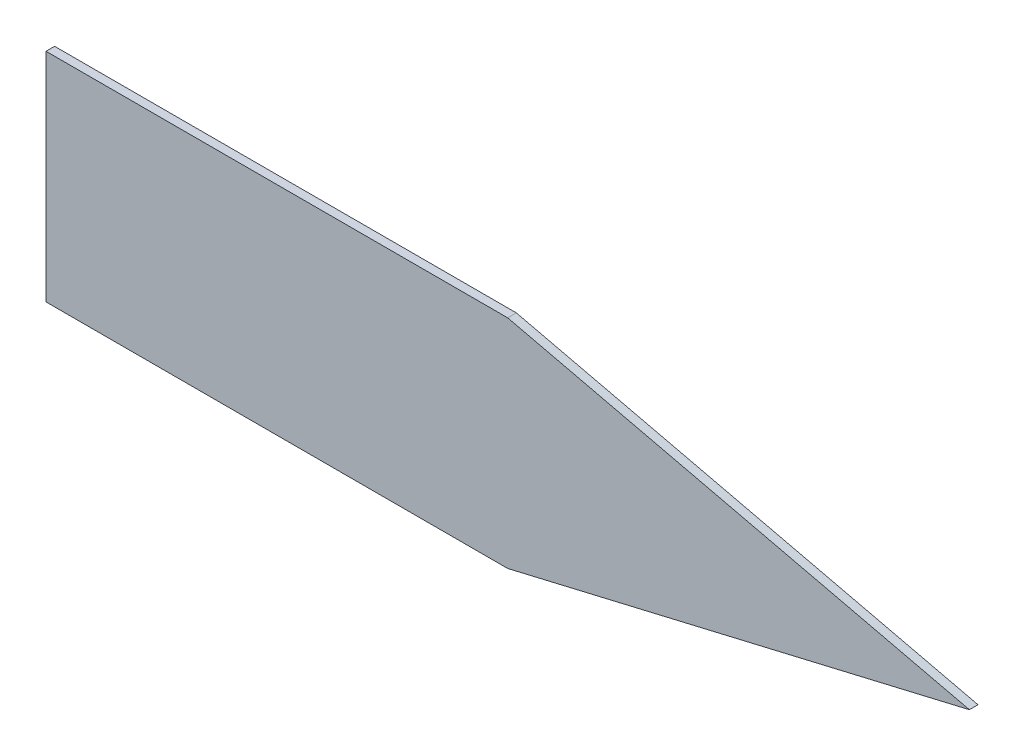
ISO-10303-21;
HEADER;
FILE_DESCRIPTION(('STEP AP214'),'2;1');
FILE_NAME('part.step','',(''),(''),'','','');
FILE_SCHEMA(('AUTOMOTIVE_DESIGN { 1 0 10303 214 1 1 1 1 }'));
ENDSEC;
DATA;
#1=APPLICATION_CONTEXT('core data for automotive mechanical design processes');
#2=APPLICATION_PROTOCOL_DEFINITION('international standard','automotive_design',2000,#1);
#3=PRODUCT_CONTEXT('',#1,'mechanical');
#4=PRODUCT('Part','Part','',(#3));
#5=PRODUCT_RELATED_PRODUCT_CATEGORY('part','',(#4));
#6=PRODUCT_DEFINITION_FORMATION('','',#4);
#7=PRODUCT_DEFINITION_CONTEXT('part definition',#1,'design');
#8=PRODUCT_DEFINITION('design','',#6,#7);
#9=PRODUCT_DEFINITION_SHAPE('','',#8);
#10=(LENGTH_UNIT() NAMED_UNIT(*) SI_UNIT(.MILLI.,.METRE.));
#11=(NAMED_UNIT(*) PLANE_ANGLE_UNIT() SI_UNIT($,.RADIAN.));
#12=(NAMED_UNIT(*) SI_UNIT($,.STERADIAN.) SOLID_ANGLE_UNIT());
#13=UNCERTAINTY_MEASURE_WITH_UNIT(LENGTH_MEASURE(1.E-05),#10,'distance_accuracy_value','');
#14=(GEOMETRIC_REPRESENTATION_CONTEXT(3) GLOBAL_UNCERTAINTY_ASSIGNED_CONTEXT((#13)) GLOBAL_UNIT_ASSIGNED_CONTEXT((#10,
#11,#12)) REPRESENTATION_CONTEXT('',''));
#15=CARTESIAN_POINT('',(0.,0.,0.));
#16=DIRECTION('',(0.,0.,1.));
#17=DIRECTION('',(1.,0.,0.));
#18=AXIS2_PLACEMENT_3D('',#15,#16,#17);
#19=CARTESIAN_POINT('',(-53.5985260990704,-12.6006072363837,0.5));
#20=DIRECTION('',(1.,0.,0.));
#21=DIRECTION('',(0.,0.,-1.));
#22=AXIS2_PLACEMENT_3D('',#19,#20,#21);
#23=PLANE('',#22);
#24=DIRECTION('',(0.,-1.,0.));
#25=VECTOR('',#24,1.);
#26=CARTESIAN_POINT('',(-53.5985260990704,-12.6006072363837,-0.5));
#27=LINE('',#26,#25);
#28=CARTESIAN_POINT('',(-53.5985260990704,12.6006072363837,-0.5));
#29=VERTEX_POINT('',#28);
#30=CARTESIAN_POINT('',(-53.5985260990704,-12.6006072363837,-0.5));
#31=VERTEX_POINT('',#30);
#32=EDGE_CURVE('E107',#29,#31,#27,.T.);
#33=ORIENTED_EDGE('',*,*,#32,.T.);
#34=DIRECTION('',(0.,0.,-1.));
#35=VECTOR('',#34,1.);
#36=CARTESIAN_POINT('',(-53.5985260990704,-12.6006072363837,0.5));
#37=LINE('',#36,#35);
#38=CARTESIAN_POINT('',(-53.5985260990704,-12.6006072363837,0.5));
#39=VERTEX_POINT('',#38);
#40=EDGE_CURVE('E11',#39,#31,#37,.T.);
#41=ORIENTED_EDGE('',*,*,#40,.F.);
#42=DIRECTION('',(0.,-1.,0.));
#43=VECTOR('',#42,1.);
#44=CARTESIAN_POINT('',(-53.5985260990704,-12.6006072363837,0.5));
#45=LINE('',#44,#43);
#46=CARTESIAN_POINT('',(-53.5985260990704,12.6006072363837,0.5));
#47=VERTEX_POINT('',#46);
#48=EDGE_CURVE('E115',#47,#39,#45,.T.);
#49=ORIENTED_EDGE('',*,*,#48,.F.);
#50=DIRECTION('',(0.,0.,-1.));
#51=VECTOR('',#50,1.);
#52=CARTESIAN_POINT('',(-53.5985260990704,12.6006072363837,0.5));
#53=LINE('',#52,#51);
#54=EDGE_CURVE('E103',#47,#29,#53,.T.);
#55=ORIENTED_EDGE('',*,*,#54,.T.);
#56=EDGE_LOOP('',(#33,#41,#49,#55));
#57=FACE_BOUND('',#56,.T.);
#58=ADVANCED_FACE('F33',(#57),#23,.F.);
#59=CARTESIAN_POINT('',(0.,-12.6006072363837,0.5));
#60=DIRECTION('',(0.,1.,0.));
#61=DIRECTION('',(0.,0.,1.));
#62=AXIS2_PLACEMENT_3D('',#59,#60,#61);
#63=PLANE('',#62);
#64=DIRECTION('',(1.,0.,0.));
#65=VECTOR('',#64,1.);
#66=CARTESIAN_POINT('',(0.,-12.6006072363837,-0.5));
#67=LINE('',#66,#65);
#68=CARTESIAN_POINT('',(0.,-12.6006072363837,-0.5));
#69=VERTEX_POINT('',#68);
#70=EDGE_CURVE('E110',#31,#69,#67,.T.);
#71=ORIENTED_EDGE('',*,*,#70,.T.);
#72=DIRECTION('',(0.,0.,-1.));
#73=VECTOR('',#72,1.);
#74=CARTESIAN_POINT('',(0.,-12.6006072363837,0.5));
#75=LINE('',#74,#73);
#76=CARTESIAN_POINT('',(0.,-12.6006072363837,0.5));
#77=VERTEX_POINT('',#76);
#78=EDGE_CURVE('E41',#77,#69,#75,.T.);
#79=ORIENTED_EDGE('',*,*,#78,.F.);
#80=DIRECTION('',(1.,0.,0.));
#81=VECTOR('',#80,1.);
#82=CARTESIAN_POINT('',(0.,-12.6006072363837,0.5));
#83=LINE('',#82,#81);
#84=EDGE_CURVE('E83',#39,#77,#83,.T.);
#85=ORIENTED_EDGE('',*,*,#84,.F.);
#86=ORIENTED_EDGE('',*,*,#40,.T.);
#87=EDGE_LOOP('',(#71,#79,#85,#86));
#88=FACE_BOUND('',#87,.T.);
#89=ADVANCED_FACE('F134',(#88),#63,.F.);
#90=CARTESIAN_POINT('',(0.,-12.6006072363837,0.5));
#91=DIRECTION('',(-0.228853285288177,0.973460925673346,0.));
#92=DIRECTION('',(-0.973460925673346,-0.228853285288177,0.));
#93=AXIS2_PLACEMENT_3D('',#90,#91,#92);
#94=PLANE('',#93);
#95=DIRECTION('',(0.973460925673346,0.228853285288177,0.));
#96=VECTOR('',#95,1.);
#97=CARTESIAN_POINT('',(0.,-12.6006072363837,-0.5));
#98=LINE('',#97,#96);
#99=CARTESIAN_POINT('',(53.5985260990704,0.,-0.5));
#100=VERTEX_POINT('',#99);
#101=EDGE_CURVE('E98',#69,#100,#98,.T.);
#102=ORIENTED_EDGE('',*,*,#101,.T.);
#103=DIRECTION('',(0.,0.,-1.));
#104=VECTOR('',#103,1.);
#105=CARTESIAN_POINT('',(53.5985260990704,0.,0.5));
#106=LINE('',#105,#104);
#107=CARTESIAN_POINT('',(53.5985260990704,0.,0.5));
#108=VERTEX_POINT('',#107);
#109=EDGE_CURVE('E95',#108,#100,#106,.T.);
#110=ORIENTED_EDGE('',*,*,#109,.F.);
#111=DIRECTION('',(0.973460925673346,0.228853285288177,0.));
#112=VECTOR('',#111,1.);
#113=CARTESIAN_POINT('',(0.,-12.6006072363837,0.5));
#114=LINE('',#113,#112);
#115=EDGE_CURVE('E87',#77,#108,#114,.T.);
#116=ORIENTED_EDGE('',*,*,#115,.F.);
#117=ORIENTED_EDGE('',*,*,#78,.T.);
#118=EDGE_LOOP('',(#102,#110,#116,#117));
#119=FACE_BOUND('',#118,.T.);
#120=ADVANCED_FACE('F96',(#119),#94,.F.);
#121=CARTESIAN_POINT('',(53.5985260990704,0.,0.5));
#122=DIRECTION('',(-0.228853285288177,-0.973460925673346,0.));
#123=DIRECTION('',(0.973460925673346,-0.228853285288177,0.));
#124=AXIS2_PLACEMENT_3D('',#121,#122,#123);
#125=PLANE('',#124);
#126=DIRECTION('',(-0.973460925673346,0.228853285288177,0.));
#127=VECTOR('',#126,1.);
#128=CARTESIAN_POINT('',(53.5985260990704,0.,-0.5));
#129=LINE('',#128,#127);
#130=CARTESIAN_POINT('',(0.,12.6006072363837,-0.5));
#131=VERTEX_POINT('',#130);
#132=EDGE_CURVE('E69',#100,#131,#129,.T.);
#133=ORIENTED_EDGE('',*,*,#132,.T.);
#134=DIRECTION('',(0.,0.,-1.));
#135=VECTOR('',#134,1.);
#136=CARTESIAN_POINT('',(0.,12.6006072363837,0.5));
#137=LINE('',#136,#135);
#138=CARTESIAN_POINT('',(0.,12.6006072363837,0.5));
#139=VERTEX_POINT('',#138);
#140=EDGE_CURVE('E99',#139,#131,#137,.T.);
#141=ORIENTED_EDGE('',*,*,#140,.F.);
#142=DIRECTION('',(-0.973460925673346,0.228853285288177,0.));
#143=VECTOR('',#142,1.);
#144=CARTESIAN_POINT('',(53.5985260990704,0.,0.5));
#145=LINE('',#144,#143);
#146=EDGE_CURVE('E91',#108,#139,#145,.T.);
#147=ORIENTED_EDGE('',*,*,#146,.F.);
#148=ORIENTED_EDGE('',*,*,#109,.T.);
#149=EDGE_LOOP('',(#133,#141,#147,#148));
#150=FACE_BOUND('',#149,.T.);
#151=ADVANCED_FACE('F101',(#150),#125,.F.);
#152=CARTESIAN_POINT('',(0.,12.6006072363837,0.5));
#153=DIRECTION('',(0.,-1.,0.));
#154=DIRECTION('',(0.,0.,-1.));
#155=AXIS2_PLACEMENT_3D('',#152,#153,#154);
#156=PLANE('',#155);
#157=DIRECTION('',(-1.,0.,0.));
#158=VECTOR('',#157,1.);
#159=CARTESIAN_POINT('',(0.,12.6006072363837,-0.5));
#160=LINE('',#159,#158);
#161=EDGE_CURVE('E75',#131,#29,#160,.T.);
#162=ORIENTED_EDGE('',*,*,#161,.T.);
#163=ORIENTED_EDGE('',*,*,#54,.F.);
#164=DIRECTION('',(-1.,0.,0.));
#165=VECTOR('',#164,1.);
#166=CARTESIAN_POINT('',(0.,12.6006072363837,0.5));
#167=LINE('',#166,#165);
#168=EDGE_CURVE('E49',#139,#47,#167,.T.);
#169=ORIENTED_EDGE('',*,*,#168,.F.);
#170=ORIENTED_EDGE('',*,*,#140,.T.);
#171=EDGE_LOOP('',(#162,#163,#169,#170));
#172=FACE_BOUND('',#171,.T.);
#173=ADVANCED_FACE('F123',(#172),#156,.F.);
#174=CARTESIAN_POINT('',(0.,0.,0.5));
#175=DIRECTION('',(0.,0.,1.));
#176=DIRECTION('',(1.,0.,0.));
#177=AXIS2_PLACEMENT_3D('',#174,#175,#176);
#178=PLANE('',#177);
#179=ORIENTED_EDGE('',*,*,#48,.T.);
#180=ORIENTED_EDGE('',*,*,#84,.T.);
#181=ORIENTED_EDGE('',*,*,#115,.T.);
#182=ORIENTED_EDGE('',*,*,#146,.T.);
#183=ORIENTED_EDGE('',*,*,#168,.T.);
#184=EDGE_LOOP('',(#179,#180,#181,#182,#183));
#185=FACE_BOUND('',#184,.T.);
#186=ADVANCED_FACE('F89',(#185),#178,.T.);
#187=CARTESIAN_POINT('',(0.,0.,-0.5));
#188=DIRECTION('',(0.,0.,1.));
#189=DIRECTION('',(1.,0.,0.));
#190=AXIS2_PLACEMENT_3D('',#187,#188,#189);
#191=PLANE('',#190);
#192=ORIENTED_EDGE('',*,*,#32,.F.);
#193=ORIENTED_EDGE('',*,*,#161,.F.);
#194=ORIENTED_EDGE('',*,*,#132,.F.);
#195=ORIENTED_EDGE('',*,*,#101,.F.);
#196=ORIENTED_EDGE('',*,*,#70,.F.);
#197=EDGE_LOOP('',(#192,#193,#194,#195,#196));
#198=FACE_BOUND('',#197,.T.);
#199=ADVANCED_FACE('F119',(#198),#191,.F.);
#200=CLOSED_SHELL('',(#58,#89,#120,#151,#173,#186,#199));
#201=MANIFOLD_SOLID_BREP('B2',#200);
#202=ADVANCED_BREP_SHAPE_REPRESENTATION('',(#18,#201),#14);
#203=SHAPE_DEFINITION_REPRESENTATION(#9,#202);
ENDSEC;
END-ISO-10303-21;
